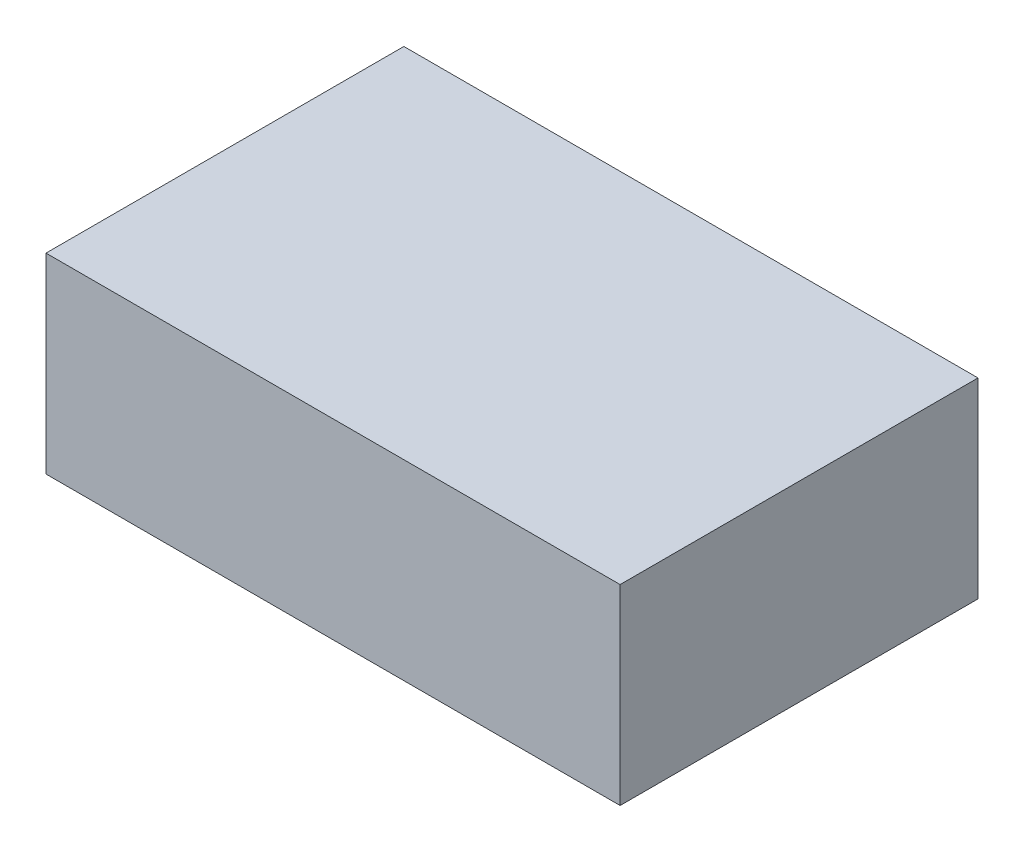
ISO-10303-21;
HEADER;
FILE_DESCRIPTION(('STEP AP214'),'2;1');
FILE_NAME('part.step','',(''),(''),'','','');
FILE_SCHEMA(('AUTOMOTIVE_DESIGN { 1 0 10303 214 1 1 1 1 }'));
ENDSEC;
DATA;
#1=APPLICATION_CONTEXT('core data for automotive mechanical design processes');
#2=APPLICATION_PROTOCOL_DEFINITION('international standard','automotive_design',2000,#1);
#3=PRODUCT_CONTEXT('',#1,'mechanical');
#4=PRODUCT('Part','Part','',(#3));
#5=PRODUCT_RELATED_PRODUCT_CATEGORY('part','',(#4));
#6=PRODUCT_DEFINITION_FORMATION('','',#4);
#7=PRODUCT_DEFINITION_CONTEXT('part definition',#1,'design');
#8=PRODUCT_DEFINITION('design','',#6,#7);
#9=PRODUCT_DEFINITION_SHAPE('','',#8);
#10=(LENGTH_UNIT() NAMED_UNIT(*) SI_UNIT(.MILLI.,.METRE.));
#11=(NAMED_UNIT(*) PLANE_ANGLE_UNIT() SI_UNIT($,.RADIAN.));
#12=(NAMED_UNIT(*) SI_UNIT($,.STERADIAN.) SOLID_ANGLE_UNIT());
#13=UNCERTAINTY_MEASURE_WITH_UNIT(LENGTH_MEASURE(1.E-05),#10,'distance_accuracy_value','');
#14=(GEOMETRIC_REPRESENTATION_CONTEXT(3) GLOBAL_UNCERTAINTY_ASSIGNED_CONTEXT((#13)) GLOBAL_UNIT_ASSIGNED_CONTEXT((#10,
#11,#12)) REPRESENTATION_CONTEXT('',''));
#15=CARTESIAN_POINT('',(0.,0.,0.));
#16=DIRECTION('',(0.,0.,1.));
#17=DIRECTION('',(1.,0.,0.));
#18=AXIS2_PLACEMENT_3D('',#15,#16,#17);
#19=CARTESIAN_POINT('',(0.,0.,0.95000064));
#20=DIRECTION('',(0.,0.,-1.));
#21=DIRECTION('',(0.,-1.,0.));
#22=AXIS2_PLACEMENT_3D('',#19,#20,#21);
#23=PLANE('',#22);
#24=DIRECTION('',(1.,0.,0.));
#25=VECTOR('',#24,1.);
#26=CARTESIAN_POINT('',(-0.762,0.254,0.95000064));
#27=LINE('',#26,#25);
#28=CARTESIAN_POINT('',(-0.762,0.254,0.95000064));
#29=VERTEX_POINT('',#28);
#30=CARTESIAN_POINT('',(0.762,0.254,0.95000064));
#31=VERTEX_POINT('',#30);
#32=EDGE_CURVE('E25',#29,#31,#27,.T.);
#33=ORIENTED_EDGE('',*,*,#32,.F.);
#34=DIRECTION('',(0.,1.,0.));
#35=VECTOR('',#34,1.);
#36=CARTESIAN_POINT('',(-0.762,-0.254,0.95000064));
#37=LINE('',#36,#35);
#38=CARTESIAN_POINT('',(-0.762,-0.254,0.95000064));
#39=VERTEX_POINT('',#38);
#40=EDGE_CURVE('E107',#39,#29,#37,.T.);
#41=ORIENTED_EDGE('',*,*,#40,.F.);
#42=DIRECTION('',(-1.,0.,0.));
#43=VECTOR('',#42,1.);
#44=CARTESIAN_POINT('',(0.762,-0.254,0.95000064));
#45=LINE('',#44,#43);
#46=CARTESIAN_POINT('',(0.762,-0.254,0.95000064));
#47=VERTEX_POINT('',#46);
#48=EDGE_CURVE('E83',#47,#39,#45,.T.);
#49=ORIENTED_EDGE('',*,*,#48,.F.);
#50=DIRECTION('',(0.,-1.,0.));
#51=VECTOR('',#50,1.);
#52=CARTESIAN_POINT('',(0.762,0.254,0.95000064));
#53=LINE('',#52,#51);
#54=EDGE_CURVE('E87',#31,#47,#53,.T.);
#55=ORIENTED_EDGE('',*,*,#54,.F.);
#56=EDGE_LOOP('',(#33,#41,#49,#55));
#57=FACE_BOUND('',#56,.T.);
#58=ADVANCED_FACE('F17',(#57),#23,.F.);
#59=CARTESIAN_POINT('',(0.,0.,0.));
#60=DIRECTION('',(0.,0.,-1.));
#61=DIRECTION('',(0.,-1.,0.));
#62=AXIS2_PLACEMENT_3D('',#59,#60,#61);
#63=PLANE('',#62);
#64=DIRECTION('',(0.,-1.,0.));
#65=VECTOR('',#64,1.);
#66=CARTESIAN_POINT('',(0.762,0.254,0.));
#67=LINE('',#66,#65);
#68=CARTESIAN_POINT('',(0.762,0.254,0.));
#69=VERTEX_POINT('',#68);
#70=CARTESIAN_POINT('',(0.762,-0.254,0.));
#71=VERTEX_POINT('',#70);
#72=EDGE_CURVE('E71',#69,#71,#67,.T.);
#73=ORIENTED_EDGE('',*,*,#72,.T.);
#74=DIRECTION('',(-1.,0.,0.));
#75=VECTOR('',#74,1.);
#76=CARTESIAN_POINT('',(0.762,-0.254,0.));
#77=LINE('',#76,#75);
#78=CARTESIAN_POINT('',(-0.762,-0.254,0.));
#79=VERTEX_POINT('',#78);
#80=EDGE_CURVE('E101',#71,#79,#77,.T.);
#81=ORIENTED_EDGE('',*,*,#80,.T.);
#82=DIRECTION('',(0.,1.,0.));
#83=VECTOR('',#82,1.);
#84=CARTESIAN_POINT('',(-0.762,-0.254,0.));
#85=LINE('',#84,#83);
#86=CARTESIAN_POINT('',(-0.762,0.254,0.));
#87=VERTEX_POINT('',#86);
#88=EDGE_CURVE('E73',#79,#87,#85,.T.);
#89=ORIENTED_EDGE('',*,*,#88,.T.);
#90=DIRECTION('',(1.,0.,0.));
#91=VECTOR('',#90,1.);
#92=CARTESIAN_POINT('',(-0.762,0.254,0.));
#93=LINE('',#92,#91);
#94=EDGE_CURVE('E11',#87,#69,#93,.T.);
#95=ORIENTED_EDGE('',*,*,#94,.T.);
#96=EDGE_LOOP('',(#73,#81,#89,#95));
#97=FACE_BOUND('',#96,.T.);
#98=ADVANCED_FACE('F69',(#97),#63,.T.);
#99=CARTESIAN_POINT('',(-0.762,0.254,0.));
#100=DIRECTION('',(0.,1.,0.));
#101=DIRECTION('',(1.,0.,0.));
#102=AXIS2_PLACEMENT_3D('',#99,#100,#101);
#103=PLANE('',#102);
#104=DIRECTION('',(0.,0.,1.));
#105=VECTOR('',#104,1.);
#106=CARTESIAN_POINT('',(-0.762,0.254,0.));
#107=LINE('',#106,#105);
#108=EDGE_CURVE('E110',#87,#29,#107,.T.);
#109=ORIENTED_EDGE('',*,*,#108,.T.);
#110=ORIENTED_EDGE('',*,*,#32,.T.);
#111=DIRECTION('',(0.,0.,1.));
#112=VECTOR('',#111,1.);
#113=CARTESIAN_POINT('',(0.762,0.254,0.));
#114=LINE('',#113,#112);
#115=EDGE_CURVE('E79',#69,#31,#114,.T.);
#116=ORIENTED_EDGE('',*,*,#115,.F.);
#117=ORIENTED_EDGE('',*,*,#94,.F.);
#118=EDGE_LOOP('',(#109,#110,#116,#117));
#119=FACE_BOUND('',#118,.T.);
#120=ADVANCED_FACE('F85',(#119),#103,.T.);
#121=CARTESIAN_POINT('',(-0.762,-0.254,0.));
#122=DIRECTION('',(-1.,0.,0.));
#123=DIRECTION('',(0.,0.,1.));
#124=AXIS2_PLACEMENT_3D('',#121,#122,#123);
#125=PLANE('',#124);
#126=DIRECTION('',(0.,0.,1.));
#127=VECTOR('',#126,1.);
#128=CARTESIAN_POINT('',(-0.762,-0.254,0.));
#129=LINE('',#128,#127);
#130=EDGE_CURVE('E97',#79,#39,#129,.T.);
#131=ORIENTED_EDGE('',*,*,#130,.T.);
#132=ORIENTED_EDGE('',*,*,#40,.T.);
#133=ORIENTED_EDGE('',*,*,#108,.F.);
#134=ORIENTED_EDGE('',*,*,#88,.F.);
#135=EDGE_LOOP('',(#131,#132,#133,#134));
#136=FACE_BOUND('',#135,.T.);
#137=ADVANCED_FACE('F171',(#136),#125,.T.);
#138=CARTESIAN_POINT('',(0.762,-0.254,0.));
#139=DIRECTION('',(0.,-1.,0.));
#140=DIRECTION('',(0.,0.,-1.));
#141=AXIS2_PLACEMENT_3D('',#138,#139,#140);
#142=PLANE('',#141);
#143=DIRECTION('',(0.,0.,1.));
#144=VECTOR('',#143,1.);
#145=CARTESIAN_POINT('',(0.762,-0.254,0.));
#146=LINE('',#145,#144);
#147=EDGE_CURVE('E81',#71,#47,#146,.T.);
#148=ORIENTED_EDGE('',*,*,#147,.T.);
#149=ORIENTED_EDGE('',*,*,#48,.T.);
#150=ORIENTED_EDGE('',*,*,#130,.F.);
#151=ORIENTED_EDGE('',*,*,#80,.F.);
#152=EDGE_LOOP('',(#148,#149,#150,#151));
#153=FACE_BOUND('',#152,.T.);
#154=ADVANCED_FACE('F160',(#153),#142,.T.);
#155=CARTESIAN_POINT('',(0.762,0.254,0.));
#156=DIRECTION('',(1.,0.,0.));
#157=DIRECTION('',(0.,1.,0.));
#158=AXIS2_PLACEMENT_3D('',#155,#156,#157);
#159=PLANE('',#158);
#160=ORIENTED_EDGE('',*,*,#115,.T.);
#161=ORIENTED_EDGE('',*,*,#54,.T.);
#162=ORIENTED_EDGE('',*,*,#147,.F.);
#163=ORIENTED_EDGE('',*,*,#72,.F.);
#164=EDGE_LOOP('',(#160,#161,#162,#163));
#165=FACE_BOUND('',#164,.T.);
#166=ADVANCED_FACE('F77',(#165),#159,.T.);
#167=CLOSED_SHELL('',(#58,#98,#120,#137,#154,#166));
#168=MANIFOLD_SOLID_BREP('B1',#167);
#169=ADVANCED_BREP_SHAPE_REPRESENTATION('',(#18,#168),#14);
#170=SHAPE_DEFINITION_REPRESENTATION(#9,#169);
ENDSEC;
END-ISO-10303-21;
